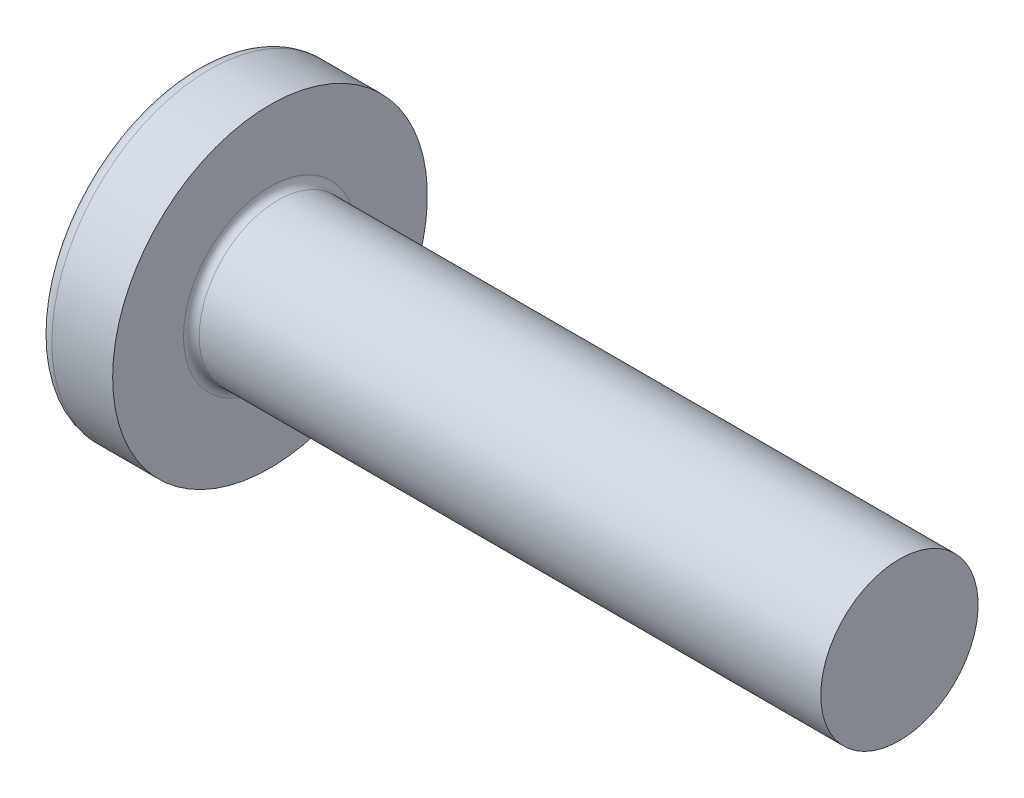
ISO-10303-21;
HEADER;
FILE_DESCRIPTION(('STEP AP214'),'2;1');
FILE_NAME('part.step','',(''),(''),'','','');
FILE_SCHEMA(('AUTOMOTIVE_DESIGN { 1 0 10303 214 1 1 1 1 }'));
ENDSEC;
DATA;
#1=APPLICATION_CONTEXT('core data for automotive mechanical design processes');
#2=APPLICATION_PROTOCOL_DEFINITION('international standard','automotive_design',2000,#1);
#3=PRODUCT_CONTEXT('',#1,'mechanical');
#4=PRODUCT('Part','Part','',(#3));
#5=PRODUCT_RELATED_PRODUCT_CATEGORY('part','',(#4));
#6=PRODUCT_DEFINITION_FORMATION('','',#4);
#7=PRODUCT_DEFINITION_CONTEXT('part definition',#1,'design');
#8=PRODUCT_DEFINITION('design','',#6,#7);
#9=PRODUCT_DEFINITION_SHAPE('','',#8);
#10=(LENGTH_UNIT() NAMED_UNIT(*) SI_UNIT(.MILLI.,.METRE.));
#11=(NAMED_UNIT(*) PLANE_ANGLE_UNIT() SI_UNIT($,.RADIAN.));
#12=(NAMED_UNIT(*) SI_UNIT($,.STERADIAN.) SOLID_ANGLE_UNIT());
#13=UNCERTAINTY_MEASURE_WITH_UNIT(LENGTH_MEASURE(1.E-05),#10,'distance_accuracy_value','');
#14=(GEOMETRIC_REPRESENTATION_CONTEXT(3) GLOBAL_UNCERTAINTY_ASSIGNED_CONTEXT((#13)) GLOBAL_UNIT_ASSIGNED_CONTEXT((#10,
#11,#12)) REPRESENTATION_CONTEXT('',''));
#15=CARTESIAN_POINT('',(0.,0.,0.));
#16=DIRECTION('',(0.,0.,1.));
#17=DIRECTION('',(1.,0.,0.));
#18=AXIS2_PLACEMENT_3D('',#15,#16,#17);
#19=CARTESIAN_POINT('',(6.5,0.,0.));
#20=DIRECTION('',(-1.,0.,0.));
#21=DIRECTION('',(0.,1.,0.));
#22=AXIS2_PLACEMENT_3D('',#19,#20,#21);
#23=SPHERICAL_SURFACE('',#22,6.5);
#24=CARTESIAN_POINT('',(1.26538895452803,0.,0.));
#25=DIRECTION('',(-1.,0.,0.));
#26=DIRECTION('',(0.,0.,1.));
#27=AXIS2_PLACEMENT_3D('',#24,#25,#26);
#28=CIRCLE('',#27,3.85342019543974);
#29=CARTESIAN_POINT('',(1.26538895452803,0.,3.85342019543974));
#30=VERTEX_POINT('',#29);
#31=EDGE_CURVE('E209',#30,#30,#28,.T.);
#32=ORIENTED_EDGE('',*,*,#31,.T.);
#33=EDGE_LOOP('',(#32));
#34=FACE_BOUND('',#33,.T.);
#35=CARTESIAN_POINT('',(0.0788099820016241,0.,0.));
#36=DIRECTION('',(1.,0.,0.));
#37=DIRECTION('',(0.,0.,-1.));
#38=AXIS2_PLACEMENT_3D('',#35,#36,#37);
#39=CIRCLE('',#38,1.0091178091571);
#40=CARTESIAN_POINT('',(0.0788099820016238,-0.514999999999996,-0.867809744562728));
#41=VERTEX_POINT('',#40);
#42=CARTESIAN_POINT('',(0.0788099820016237,-0.867809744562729,-0.515));
#43=VERTEX_POINT('',#42);
#44=EDGE_CURVE('E397',#41,#43,#39,.F.);
#45=ORIENTED_EDGE('',*,*,#44,.F.);
#46=CARTESIAN_POINT('',(6.5,-0.515,0.));
#47=DIRECTION('',(0.,1.,0.));
#48=DIRECTION('',(0.,0.,1.));
#49=AXIS2_PLACEMENT_3D('',#46,#47,#48);
#50=CIRCLE('',#49,6.47956595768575);
#51=CARTESIAN_POINT('',(0.331830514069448,-0.514999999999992,-1.98455541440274));
#52=VERTEX_POINT('',#51);
#53=EDGE_CURVE('E254',#52,#41,#50,.T.);
#54=ORIENTED_EDGE('',*,*,#53,.F.);
#55=CARTESIAN_POINT('',(6.06443205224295,0.,0.873614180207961));
#56=DIRECTION('',(0.446197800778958,0.,-0.89493436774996));
#57=DIRECTION('',(-0.89493436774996,0.,-0.446197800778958));
#58=AXIS2_PLACEMENT_3D('',#55,#56,#57);
#59=CIRCLE('',#58,6.4262803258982);
#60=CARTESIAN_POINT('',(0.331830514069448,0.515000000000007,-1.98455541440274));
#61=VERTEX_POINT('',#60);
#62=EDGE_CURVE('E228',#52,#61,#59,.T.);
#63=ORIENTED_EDGE('',*,*,#62,.T.);
#64=CARTESIAN_POINT('',(6.5,0.515,0.));
#65=DIRECTION('',(0.,-1.,0.));
#66=DIRECTION('',(0.,0.,-1.));
#67=AXIS2_PLACEMENT_3D('',#64,#65,#66);
#68=CIRCLE('',#67,6.47956595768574);
#69=CARTESIAN_POINT('',(0.0788099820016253,0.515000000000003,-0.867809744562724));
#70=VERTEX_POINT('',#69);
#71=EDGE_CURVE('E262',#70,#61,#68,.T.);
#72=ORIENTED_EDGE('',*,*,#71,.F.);
#73=CARTESIAN_POINT('',(0.0788099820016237,0.867809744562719,-0.515));
#74=VERTEX_POINT('',#73);
#75=EDGE_CURVE('E329',#74,#70,#39,.F.);
#76=ORIENTED_EDGE('',*,*,#75,.F.);
#77=CARTESIAN_POINT('',(6.5,0.,-0.515));
#78=DIRECTION('',(0.,0.,1.));
#79=DIRECTION('',(1.,0.,0.));
#80=AXIS2_PLACEMENT_3D('',#77,#78,#79);
#81=CIRCLE('',#80,6.47956595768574);
#82=CARTESIAN_POINT('',(0.331830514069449,1.98455541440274,-0.515));
#83=VERTEX_POINT('',#82);
#84=EDGE_CURVE('E222',#83,#74,#81,.T.);
#85=ORIENTED_EDGE('',*,*,#84,.F.);
#86=CARTESIAN_POINT('',(6.06443205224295,-0.873614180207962,0.));
#87=DIRECTION('',(0.446197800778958,0.89493436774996,0.));
#88=DIRECTION('',(-0.89493436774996,0.446197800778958,0.));
#89=AXIS2_PLACEMENT_3D('',#86,#87,#88);
#90=CIRCLE('',#89,6.4262803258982);
#91=CARTESIAN_POINT('',(0.331830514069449,1.98455541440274,0.514999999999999));
#92=VERTEX_POINT('',#91);
#93=EDGE_CURVE('E225',#83,#92,#90,.T.);
#94=ORIENTED_EDGE('',*,*,#93,.T.);
#95=CARTESIAN_POINT('',(6.5,0.,0.515));
#96=DIRECTION('',(0.,0.,-1.));
#97=DIRECTION('',(0.,1.,0.));
#98=AXIS2_PLACEMENT_3D('',#95,#96,#97);
#99=CIRCLE('',#98,6.47956595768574);
#100=CARTESIAN_POINT('',(0.0788099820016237,0.867809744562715,0.514999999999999));
#101=VERTEX_POINT('',#100);
#102=EDGE_CURVE('E218',#101,#92,#99,.T.);
#103=ORIENTED_EDGE('',*,*,#102,.F.);
#104=CARTESIAN_POINT('',(0.0788099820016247,0.514999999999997,0.867809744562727));
#105=VERTEX_POINT('',#104);
#106=EDGE_CURVE('E359',#105,#101,#39,.F.);
#107=ORIENTED_EDGE('',*,*,#106,.F.);
#108=CARTESIAN_POINT('',(0.331830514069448,0.514999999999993,1.98455541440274));
#109=VERTEX_POINT('',#108);
#110=EDGE_CURVE('E238',#109,#105,#68,.T.);
#111=ORIENTED_EDGE('',*,*,#110,.F.);
#112=CARTESIAN_POINT('',(6.06443205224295,0.,-0.873614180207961));
#113=DIRECTION('',(0.446197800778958,0.,0.89493436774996));
#114=DIRECTION('',(0.89493436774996,0.,-0.446197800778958));
#115=AXIS2_PLACEMENT_3D('',#112,#113,#114);
#116=CIRCLE('',#115,6.4262803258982);
#117=CARTESIAN_POINT('',(0.331830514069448,-0.515000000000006,1.98455541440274));
#118=VERTEX_POINT('',#117);
#119=EDGE_CURVE('E43',#109,#118,#116,.T.);
#120=ORIENTED_EDGE('',*,*,#119,.T.);
#121=CARTESIAN_POINT('',(0.0788099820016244,-0.515000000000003,0.867809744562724));
#122=VERTEX_POINT('',#121);
#123=EDGE_CURVE('E235',#122,#118,#50,.T.);
#124=ORIENTED_EDGE('',*,*,#123,.F.);
#125=CARTESIAN_POINT('',(0.0788099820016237,-0.867809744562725,0.514999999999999));
#126=VERTEX_POINT('',#125);
#127=EDGE_CURVE('E393',#126,#122,#39,.F.);
#128=ORIENTED_EDGE('',*,*,#127,.F.);
#129=CARTESIAN_POINT('',(0.331830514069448,-1.98455541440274,0.514999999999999));
#130=VERTEX_POINT('',#129);
#131=EDGE_CURVE('E219',#130,#126,#99,.T.);
#132=ORIENTED_EDGE('',*,*,#131,.F.);
#133=CARTESIAN_POINT('',(6.06443205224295,0.87361418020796,0.));
#134=DIRECTION('',(0.446197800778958,-0.89493436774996,0.));
#135=DIRECTION('',(0.89493436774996,0.446197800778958,0.));
#136=AXIS2_PLACEMENT_3D('',#133,#134,#135);
#137=CIRCLE('',#136,6.4262803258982);
#138=CARTESIAN_POINT('',(0.331830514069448,-1.98455541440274,-0.515));
#139=VERTEX_POINT('',#138);
#140=EDGE_CURVE('E215',#130,#139,#137,.T.);
#141=ORIENTED_EDGE('',*,*,#140,.T.);
#142=EDGE_CURVE('E58',#43,#139,#81,.T.);
#143=ORIENTED_EDGE('',*,*,#142,.F.);
#144=EDGE_LOOP('',(#45,#54,#63,#72,#76,#85,#94,#103,#107,#111,#120,#124,#128,#132,#141,#143));
#145=FACE_BOUND('',#144,.T.);
#146=ADVANCED_FACE('F30',(#34,#145),#23,.T.);
#147=CARTESIAN_POINT('',(0.,2.15,-0.515));
#148=DIRECTION('',(0.,0.,1.));
#149=DIRECTION('',(1.,0.,0.));
#150=AXIS2_PLACEMENT_3D('',#147,#148,#149);
#151=PLANE('',#150);
#152=ORIENTED_EDGE('',*,*,#84,.T.);
#153=CARTESIAN_POINT('',(-1.51195208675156,0.994972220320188,-0.515));
#154=CARTESIAN_POINT('',(-1.20405981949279,0.970722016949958,-0.515));
#155=CARTESIAN_POINT('',(-0.896180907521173,0.946299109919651,-0.515));
#156=CARTESIAN_POINT('',(-0.280449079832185,0.896981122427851,-0.515));
#157=CARTESIAN_POINT('',(0.0274038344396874,0.872086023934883,-0.515));
#158=CARTESIAN_POINT('',(0.489146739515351,0.83429553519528,-0.515));
#159=CARTESIAN_POINT('',(0.643055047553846,0.821624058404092,-0.515));
#160=CARTESIAN_POINT('',(0.950856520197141,0.796108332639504,-0.515));
#161=CARTESIAN_POINT('',(1.10474968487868,0.783264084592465,-0.515));
#162=CARTESIAN_POINT('',(1.41251352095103,0.757376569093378,-0.515));
#163=CARTESIAN_POINT('',(1.56638419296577,0.744333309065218,-0.515));
#164=CARTESIAN_POINT('',(1.87410847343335,0.718013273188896,-0.515));
#165=CARTESIAN_POINT('',(2.02796208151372,0.704736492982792,-0.515));
#166=CARTESIAN_POINT('',(2.36455311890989,0.675386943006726,-0.515));
#167=CARTESIAN_POINT('',(2.54728562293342,0.659257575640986,-0.515));
#168=CARTESIAN_POINT('',(2.91270624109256,0.626517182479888,-0.515));
#169=CARTESIAN_POINT('',(3.09539435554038,0.609906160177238,-0.515));
#170=CARTESIAN_POINT('',(3.46069832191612,0.576073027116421,-0.515));
#171=CARTESIAN_POINT('',(3.64331417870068,0.558850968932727,-0.515));
#172=CARTESIAN_POINT('',(4.00847437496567,0.523604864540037,-0.515));
#173=CARTESIAN_POINT('',(4.19101871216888,0.505580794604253,-0.515));
#174=CARTESIAN_POINT('',(4.55606208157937,0.468429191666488,-0.515));
#175=CARTESIAN_POINT('',(4.73856107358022,0.449301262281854,-0.515));
#176=CARTESIAN_POINT('',(5.10337547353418,0.409473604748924,-0.515));
#177=CARTESIAN_POINT('',(5.28569089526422,0.38877400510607,-0.515));
#178=CARTESIAN_POINT('',(5.55897278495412,0.355828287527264,-0.515));
#179=CARTESIAN_POINT('',(5.65005277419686,0.344527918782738,-0.515));
#180=CARTESIAN_POINT('',(5.83209904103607,0.321075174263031,-0.515));
#181=CARTESIAN_POINT('',(5.92306532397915,0.308922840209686,-0.515));
#182=CARTESIAN_POINT('',(6.10486078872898,0.28342733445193,-0.515));
#183=CARTESIAN_POINT('',(6.1956899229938,0.270083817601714,-0.515));
#184=CARTESIAN_POINT('',(6.33172773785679,0.248701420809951,-0.515));
#185=CARTESIAN_POINT('',(6.37704304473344,0.241345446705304,-0.515));
#186=CARTESIAN_POINT('',(6.4675722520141,0.226018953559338,-0.515));
#187=CARTESIAN_POINT('',(6.51278614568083,0.218048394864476,-0.515));
#188=CARTESIAN_POINT('',(6.55793125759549,0.209691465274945,-0.515));
#189=B_SPLINE_CURVE_WITH_KNOTS('',3,(#153,#154,#155,#156,#157,#158,#159,#160,#161,#162,#163,
#164,#165,#166,#167,#168,#169,#170,#171,#172,#173,#174,#175,#176,#177,#178,#179,#180,#181,#182,
#183,#184,#185,#186,#187,#188),.UNSPECIFIED.,.F.,.F.,(4,2,2,2,2,2,2,2,2,2,2,2,2,2,2,2,2,4),(0.,
0.926537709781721,1.85311087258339,2.31639796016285,2.77968256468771,3.24294992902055,
3.70622594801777,4.25655436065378,4.80687878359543,5.35715597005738,5.90744944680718,
6.45794177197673,7.008389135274,7.28372117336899,7.55903973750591,7.83443833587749,
7.97216007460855,8.10989070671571),.UNSPECIFIED.);
#190=CARTESIAN_POINT('',(2.34,0.677477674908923,-0.515));
#191=VERTEX_POINT('',#190);
#192=EDGE_CURVE('E322',#74,#191,#189,.T.);
#193=ORIENTED_EDGE('',*,*,#192,.T.);
#194=DIRECTION('',(0.,1.,0.));
#195=VECTOR('',#194,1.);
#196=CARTESIAN_POINT('',(2.34,-0.983319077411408,-0.515));
#197=LINE('',#196,#195);
#198=CARTESIAN_POINT('',(2.34,0.983319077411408,-0.515));
#199=VERTEX_POINT('',#198);
#200=EDGE_CURVE('E277',#191,#199,#197,.T.);
#201=ORIENTED_EDGE('',*,*,#200,.T.);
#202=DIRECTION('',(0.89493436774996,-0.446197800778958,0.));
#203=VECTOR('',#202,1.);
#204=CARTESIAN_POINT('',(0.,2.15,-0.515));
#205=LINE('',#204,#203);
#206=EDGE_CURVE('E283',#83,#199,#205,.T.);
#207=ORIENTED_EDGE('',*,*,#206,.F.);
#208=EDGE_LOOP('',(#152,#193,#201,#207));
#209=FACE_BOUND('',#208,.T.);
#210=ADVANCED_FACE('F164',(#209),#151,.T.);
#211=CARTESIAN_POINT('',(2.34,-0.983319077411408,-0.515));
#212=VERTEX_POINT('',#211);
#213=CARTESIAN_POINT('',(2.34,-0.677477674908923,-0.515));
#214=VERTEX_POINT('',#213);
#215=EDGE_CURVE('E274',#212,#214,#197,.T.);
#216=ORIENTED_EDGE('',*,*,#215,.T.);
#217=CARTESIAN_POINT('',(-1.51195208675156,-0.994972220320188,-0.515));
#218=CARTESIAN_POINT('',(-1.20405981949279,-0.970722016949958,-0.515));
#219=CARTESIAN_POINT('',(-0.896180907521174,-0.946299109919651,-0.515));
#220=CARTESIAN_POINT('',(-0.280449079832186,-0.896981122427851,-0.515));
#221=CARTESIAN_POINT('',(0.0274038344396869,-0.872086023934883,-0.515));
#222=CARTESIAN_POINT('',(0.48914673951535,-0.83429553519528,-0.515));
#223=CARTESIAN_POINT('',(0.643055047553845,-0.821624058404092,-0.515));
#224=CARTESIAN_POINT('',(0.95085652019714,-0.796108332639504,-0.515));
#225=CARTESIAN_POINT('',(1.10474968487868,-0.783264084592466,-0.515));
#226=CARTESIAN_POINT('',(1.41251352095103,-0.757376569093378,-0.515));
#227=CARTESIAN_POINT('',(1.56638419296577,-0.744333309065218,-0.515));
#228=CARTESIAN_POINT('',(1.87410847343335,-0.718013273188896,-0.515));
#229=CARTESIAN_POINT('',(2.02796208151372,-0.704736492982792,-0.515));
#230=CARTESIAN_POINT('',(2.36455311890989,-0.675386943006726,-0.515));
#231=CARTESIAN_POINT('',(2.54728562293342,-0.659257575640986,-0.515));
#232=CARTESIAN_POINT('',(2.91270624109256,-0.626517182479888,-0.515));
#233=CARTESIAN_POINT('',(3.09539435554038,-0.609906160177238,-0.515));
#234=CARTESIAN_POINT('',(3.46069832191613,-0.576073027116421,-0.515));
#235=CARTESIAN_POINT('',(3.64331417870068,-0.558850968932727,-0.515));
#236=CARTESIAN_POINT('',(4.00847437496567,-0.523604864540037,-0.515));
#237=CARTESIAN_POINT('',(4.19101871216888,-0.505580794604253,-0.515));
#238=CARTESIAN_POINT('',(4.55606208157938,-0.468429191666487,-0.515));
#239=CARTESIAN_POINT('',(4.73856107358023,-0.449301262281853,-0.515));
#240=CARTESIAN_POINT('',(5.10337547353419,-0.409473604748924,-0.515));
#241=CARTESIAN_POINT('',(5.28569089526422,-0.388774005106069,-0.515));
#242=CARTESIAN_POINT('',(5.55897278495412,-0.355828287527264,-0.515));
#243=CARTESIAN_POINT('',(5.65005277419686,-0.344527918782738,-0.515));
#244=CARTESIAN_POINT('',(5.83209904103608,-0.321075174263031,-0.515));
#245=CARTESIAN_POINT('',(5.92306532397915,-0.308922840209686,-0.515));
#246=CARTESIAN_POINT('',(6.10486078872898,-0.28342733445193,-0.515));
#247=CARTESIAN_POINT('',(6.1956899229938,-0.270083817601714,-0.515));
#248=CARTESIAN_POINT('',(6.33172773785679,-0.248701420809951,-0.515));
#249=CARTESIAN_POINT('',(6.37704304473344,-0.241345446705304,-0.515));
#250=CARTESIAN_POINT('',(6.4675722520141,-0.226018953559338,-0.515));
#251=CARTESIAN_POINT('',(6.51278614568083,-0.218048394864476,-0.515));
#252=CARTESIAN_POINT('',(6.55793125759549,-0.209691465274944,-0.515));
#253=B_SPLINE_CURVE_WITH_KNOTS('',3,(#217,#218,#219,#220,#221,#222,#223,#224,#225,#226,#227,
#228,#229,#230,#231,#232,#233,#234,#235,#236,#237,#238,#239,#240,#241,#242,#243,#244,#245,#246,
#247,#248,#249,#250,#251,#252),.UNSPECIFIED.,.F.,.F.,(4,2,2,2,2,2,2,2,2,2,2,2,2,2,2,2,2,4),(0.,
0.926537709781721,1.85311087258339,2.31639796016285,2.77968256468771,3.24294992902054,
3.70622594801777,4.25655436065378,4.80687878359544,5.35715597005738,5.90744944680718,
6.45794177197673,7.008389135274,7.28372117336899,7.55903973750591,7.83443833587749,
7.97216007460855,8.10989070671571),.UNSPECIFIED.);
#254=EDGE_CURVE('E315',#214,#43,#253,.F.);
#255=ORIENTED_EDGE('',*,*,#254,.T.);
#256=ORIENTED_EDGE('',*,*,#142,.T.);
#257=DIRECTION('',(0.89493436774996,0.446197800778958,0.));
#258=VECTOR('',#257,1.);
#259=CARTESIAN_POINT('',(0.,-2.15,-0.515));
#260=LINE('',#259,#258);
#261=EDGE_CURVE('E280',#139,#212,#260,.T.);
#262=ORIENTED_EDGE('',*,*,#261,.T.);
#263=EDGE_LOOP('',(#216,#255,#256,#262));
#264=FACE_BOUND('',#263,.T.);
#265=ADVANCED_FACE('F171',(#264),#151,.T.);
#266=CARTESIAN_POINT('',(0.,-2.15,0.514999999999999));
#267=DIRECTION('',(0.,0.,-1.));
#268=DIRECTION('',(0.,1.,0.));
#269=AXIS2_PLACEMENT_3D('',#266,#267,#268);
#270=PLANE('',#269);
#271=DIRECTION('',(0.,-1.,0.));
#272=VECTOR('',#271,1.);
#273=CARTESIAN_POINT('',(2.34,0.983319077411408,0.515));
#274=LINE('',#273,#272);
#275=CARTESIAN_POINT('',(2.34,0.983319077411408,0.515));
#276=VERTEX_POINT('',#275);
#277=CARTESIAN_POINT('',(2.34,0.677477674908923,0.515));
#278=VERTEX_POINT('',#277);
#279=EDGE_CURVE('E267',#276,#278,#274,.T.);
#280=ORIENTED_EDGE('',*,*,#279,.T.);
#281=CARTESIAN_POINT('',(-1.51195208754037,0.994972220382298,0.514999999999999));
#282=CARTESIAN_POINT('',(-1.20405982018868,0.970722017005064,0.514999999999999));
#283=CARTESIAN_POINT('',(-0.896180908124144,0.946299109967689,0.514999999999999));
#284=CARTESIAN_POINT('',(-0.280449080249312,0.896981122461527,0.515));
#285=CARTESIAN_POINT('',(0.0274038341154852,0.872086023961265,0.515));
#286=CARTESIAN_POINT('',(0.489146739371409,0.834295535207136,0.515));
#287=CARTESIAN_POINT('',(0.643055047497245,0.821624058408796,0.515));
#288=CARTESIAN_POINT('',(0.950856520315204,0.796108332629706,0.515));
#289=CARTESIAN_POINT('',(1.10474968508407,0.783264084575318,0.515));
#290=CARTESIAN_POINT('',(1.41251352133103,0.757376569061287,0.515));
#291=CARTESIAN_POINT('',(1.56638419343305,0.744333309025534,0.515));
#292=CARTESIAN_POINT('',(1.87410847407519,0.718013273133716,0.515));
#293=CARTESIAN_POINT('',(2.02796208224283,0.70473649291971,0.515));
#294=CARTESIAN_POINT('',(2.36455311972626,0.675386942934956,0.515));
#295=CARTESIAN_POINT('',(2.5472856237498,0.659257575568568,0.515));
#296=CARTESIAN_POINT('',(2.91270624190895,0.626517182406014,0.515));
#297=CARTESIAN_POINT('',(3.09539435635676,0.609906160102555,0.515));
#298=CARTESIAN_POINT('',(3.46069832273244,0.576073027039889,0.515));
#299=CARTESIAN_POINT('',(3.64331417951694,0.558850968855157,0.515));
#300=CARTESIAN_POINT('',(4.00847437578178,0.523604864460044,0.515));
#301=CARTESIAN_POINT('',(4.1910187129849,0.505580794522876,0.515));
#302=CARTESIAN_POINT('',(4.55606208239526,0.46842919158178,0.515));
#303=CARTESIAN_POINT('',(4.73856107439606,0.449301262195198,0.515));
#304=CARTESIAN_POINT('',(5.10337547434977,0.409473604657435,0.515));
#305=CARTESIAN_POINT('',(5.28569089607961,0.388774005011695,0.515));
#306=CARTESIAN_POINT('',(5.55897278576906,0.355828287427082,0.515));
#307=CARTESIAN_POINT('',(5.65005277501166,0.344527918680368,0.515));
#308=CARTESIAN_POINT('',(5.83209904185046,0.321075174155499,0.515));
#309=CARTESIAN_POINT('',(5.92306532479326,0.30892284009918,0.515));
#310=CARTESIAN_POINT('',(6.10486078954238,0.283427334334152,0.515));
#311=CARTESIAN_POINT('',(6.19568992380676,0.270083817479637,0.515));
#312=CARTESIAN_POINT('',(6.33172773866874,0.248701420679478,0.515));
#313=CARTESIAN_POINT('',(6.377043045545,0.241345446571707,0.515));
#314=CARTESIAN_POINT('',(6.46757225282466,0.226018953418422,0.515));
#315=CARTESIAN_POINT('',(6.51278614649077,0.218048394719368,0.515));
#316=CARTESIAN_POINT('',(6.55793125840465,0.209691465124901,0.515));
#317=B_SPLINE_CURVE_WITH_KNOTS('',3,(#281,#282,#283,#284,#285,#286,#287,#288,#289,#290,#291,
#292,#293,#294,#295,#296,#297,#298,#299,#300,#301,#302,#303,#304,#305,#306,#307,#308,#309,#310,
#311,#312,#313,#314,#315,#316),.UNSPECIFIED.,.F.,.F.,(4,2,2,2,2,2,2,2,2,2,2,2,2,2,2,2,2,4),(0.,
0.926537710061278,1.85311087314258,2.31639796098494,2.77968256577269,3.24294993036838,
3.70622594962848,4.25655436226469,4.80687878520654,5.3571559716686,5.90744944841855,
6.45794177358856,7.00838913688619,7.28372117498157,7.55903973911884,7.83443833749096,
7.97216007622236,8.10989070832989),.UNSPECIFIED.);
#318=EDGE_CURVE('E360',#278,#101,#317,.F.);
#319=ORIENTED_EDGE('',*,*,#318,.T.);
#320=ORIENTED_EDGE('',*,*,#102,.T.);
#321=DIRECTION('',(0.89493436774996,-0.446197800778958,0.));
#322=VECTOR('',#321,1.);
#323=CARTESIAN_POINT('',(0.,2.15,0.515));
#324=LINE('',#323,#322);
#325=EDGE_CURVE('E282',#92,#276,#324,.T.);
#326=ORIENTED_EDGE('',*,*,#325,.T.);
#327=EDGE_LOOP('',(#280,#319,#320,#326));
#328=FACE_BOUND('',#327,.T.);
#329=ADVANCED_FACE('F310',(#328),#270,.T.);
#330=ORIENTED_EDGE('',*,*,#131,.T.);
#331=CARTESIAN_POINT('',(-1.51195208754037,-0.994972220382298,0.514999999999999));
#332=CARTESIAN_POINT('',(-1.20405982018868,-0.970722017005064,0.514999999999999));
#333=CARTESIAN_POINT('',(-0.896180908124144,-0.946299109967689,0.514999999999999));
#334=CARTESIAN_POINT('',(-0.280449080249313,-0.896981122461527,0.514999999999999));
#335=CARTESIAN_POINT('',(0.0274038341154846,-0.872086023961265,0.514999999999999));
#336=CARTESIAN_POINT('',(0.489146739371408,-0.834295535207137,0.514999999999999));
#337=CARTESIAN_POINT('',(0.643055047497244,-0.821624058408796,0.514999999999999));
#338=CARTESIAN_POINT('',(0.950856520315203,-0.796108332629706,0.514999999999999));
#339=CARTESIAN_POINT('',(1.10474968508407,-0.783264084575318,0.514999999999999));
#340=CARTESIAN_POINT('',(1.41251352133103,-0.757376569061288,0.514999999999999));
#341=CARTESIAN_POINT('',(1.56638419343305,-0.744333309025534,0.515));
#342=CARTESIAN_POINT('',(1.87410847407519,-0.718013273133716,0.515));
#343=CARTESIAN_POINT('',(2.02796208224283,-0.70473649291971,0.515));
#344=CARTESIAN_POINT('',(2.36455311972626,-0.675386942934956,0.515));
#345=CARTESIAN_POINT('',(2.5472856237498,-0.659257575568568,0.515));
#346=CARTESIAN_POINT('',(2.91270624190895,-0.626517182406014,0.515));
#347=CARTESIAN_POINT('',(3.09539435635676,-0.609906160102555,0.515));
#348=CARTESIAN_POINT('',(3.46069832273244,-0.576073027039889,0.515));
#349=CARTESIAN_POINT('',(3.64331417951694,-0.558850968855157,0.515));
#350=CARTESIAN_POINT('',(4.00847437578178,-0.523604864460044,0.515));
#351=CARTESIAN_POINT('',(4.1910187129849,-0.505580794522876,0.515));
#352=CARTESIAN_POINT('',(4.55606208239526,-0.46842919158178,0.515));
#353=CARTESIAN_POINT('',(4.73856107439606,-0.449301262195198,0.515));
#354=CARTESIAN_POINT('',(5.10337547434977,-0.409473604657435,0.515));
#355=CARTESIAN_POINT('',(5.28569089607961,-0.388774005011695,0.515));
#356=CARTESIAN_POINT('',(5.55897278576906,-0.355828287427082,0.515));
#357=CARTESIAN_POINT('',(5.65005277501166,-0.344527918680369,0.515));
#358=CARTESIAN_POINT('',(5.83209904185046,-0.3210751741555,0.515));
#359=CARTESIAN_POINT('',(5.92306532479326,-0.308922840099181,0.515));
#360=CARTESIAN_POINT('',(6.10486078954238,-0.283427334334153,0.515));
#361=CARTESIAN_POINT('',(6.19568992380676,-0.270083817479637,0.515));
#362=CARTESIAN_POINT('',(6.33172773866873,-0.248701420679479,0.515));
#363=CARTESIAN_POINT('',(6.37704304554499,-0.241345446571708,0.515));
#364=CARTESIAN_POINT('',(6.46757225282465,-0.226018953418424,0.515));
#365=CARTESIAN_POINT('',(6.51278614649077,-0.218048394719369,0.515));
#366=CARTESIAN_POINT('',(6.55793125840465,-0.209691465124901,0.515));
#367=B_SPLINE_CURVE_WITH_KNOTS('',3,(#331,#332,#333,#334,#335,#336,#337,#338,#339,#340,#341,
#342,#343,#344,#345,#346,#347,#348,#349,#350,#351,#352,#353,#354,#355,#356,#357,#358,#359,#360,
#361,#362,#363,#364,#365,#366),.UNSPECIFIED.,.F.,.F.,(4,2,2,2,2,2,2,2,2,2,2,2,2,2,2,2,2,4),(0.,
0.926537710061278,1.85311087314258,2.31639796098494,2.77968256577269,3.24294993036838,
3.70622594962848,4.25655436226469,4.80687878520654,5.3571559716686,5.90744944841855,
6.45794177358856,7.00838913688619,7.28372117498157,7.55903973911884,7.83443833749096,
7.97216007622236,8.10989070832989),.UNSPECIFIED.);
#368=CARTESIAN_POINT('',(2.34,-0.677477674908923,0.515));
#369=VERTEX_POINT('',#368);
#370=EDGE_CURVE('E350',#126,#369,#367,.T.);
#371=ORIENTED_EDGE('',*,*,#370,.T.);
#372=CARTESIAN_POINT('',(2.34,-0.983319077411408,0.515));
#373=VERTEX_POINT('',#372);
#374=EDGE_CURVE('E270',#369,#373,#274,.T.);
#375=ORIENTED_EDGE('',*,*,#374,.T.);
#376=DIRECTION('',(0.89493436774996,0.446197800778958,0.));
#377=VECTOR('',#376,1.);
#378=CARTESIAN_POINT('',(0.,-2.15,0.514999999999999));
#379=LINE('',#378,#377);
#380=EDGE_CURVE('E266',#130,#373,#379,.T.);
#381=ORIENTED_EDGE('',*,*,#380,.F.);
#382=EDGE_LOOP('',(#330,#371,#375,#381));
#383=FACE_BOUND('',#382,.T.);
#384=ADVANCED_FACE('F378',(#383),#270,.T.);
#385=CARTESIAN_POINT('',(2.34,0.983319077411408,-0.515));
#386=DIRECTION('',(-1.,0.,0.));
#387=DIRECTION('',(0.,0.,1.));
#388=AXIS2_PLACEMENT_3D('',#385,#386,#387);
#389=PLANE('',#388);
#390=ORIENTED_EDGE('',*,*,#374,.F.);
#391=CARTESIAN_POINT('',(2.34,0.,0.));
#392=DIRECTION('',(-1.,0.,0.));
#393=DIRECTION('',(0.,0.,1.));
#394=AXIS2_PLACEMENT_3D('',#391,#392,#393);
#395=CIRCLE('',#394,0.851);
#396=EDGE_CURVE('E392',#214,#369,#395,.T.);
#397=ORIENTED_EDGE('',*,*,#396,.F.);
#398=ORIENTED_EDGE('',*,*,#215,.F.);
#399=DIRECTION('',(0.,0.,1.));
#400=VECTOR('',#399,1.);
#401=CARTESIAN_POINT('',(2.34,-0.983319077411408,-0.515));
#402=LINE('',#401,#400);
#403=EDGE_CURVE('E263',#212,#373,#402,.T.);
#404=ORIENTED_EDGE('',*,*,#403,.T.);
#405=EDGE_LOOP('',(#390,#397,#398,#404));
#406=FACE_BOUND('',#405,.T.);
#407=ADVANCED_FACE('F375',(#406),#389,.T.);
#408=DIRECTION('',(0.,0.,-1.));
#409=VECTOR('',#408,1.);
#410=CARTESIAN_POINT('',(2.34,-0.515000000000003,0.983319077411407));
#411=LINE('',#410,#409);
#412=CARTESIAN_POINT('',(2.34,-0.514999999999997,-0.677477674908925));
#413=VERTEX_POINT('',#412);
#414=CARTESIAN_POINT('',(2.34,-0.514999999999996,-0.98331907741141));
#415=VERTEX_POINT('',#414);
#416=EDGE_CURVE('E419',#413,#415,#411,.T.);
#417=ORIENTED_EDGE('',*,*,#416,.F.);
#418=CARTESIAN_POINT('',(2.34,0.515000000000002,-0.677477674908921));
#419=VERTEX_POINT('',#418);
#420=EDGE_CURVE('E50',#419,#413,#395,.T.);
#421=ORIENTED_EDGE('',*,*,#420,.F.);
#422=DIRECTION('',(0.,0.,1.));
#423=VECTOR('',#422,1.);
#424=CARTESIAN_POINT('',(2.34,0.515000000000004,-0.983319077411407));
#425=LINE('',#424,#423);
#426=CARTESIAN_POINT('',(2.34,0.515000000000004,-0.983319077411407));
#427=VERTEX_POINT('',#426);
#428=EDGE_CURVE('E418',#427,#419,#425,.T.);
#429=ORIENTED_EDGE('',*,*,#428,.F.);
#430=DIRECTION('',(0.,-1.,0.));
#431=VECTOR('',#430,1.);
#432=CARTESIAN_POINT('',(2.34,0.515000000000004,-0.983319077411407));
#433=LINE('',#432,#431);
#434=EDGE_CURVE('E431',#427,#415,#433,.T.);
#435=ORIENTED_EDGE('',*,*,#434,.T.);
#436=EDGE_LOOP('',(#417,#421,#429,#435));
#437=FACE_BOUND('',#436,.T.);
#438=ADVANCED_FACE('F377',(#437),#389,.T.);
#439=ORIENTED_EDGE('',*,*,#200,.F.);
#440=EDGE_CURVE('E402',#278,#191,#395,.T.);
#441=ORIENTED_EDGE('',*,*,#440,.F.);
#442=ORIENTED_EDGE('',*,*,#279,.F.);
#443=DIRECTION('',(0.,0.,-1.));
#444=VECTOR('',#443,1.);
#445=CARTESIAN_POINT('',(2.34,0.983319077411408,0.515));
#446=LINE('',#445,#444);
#447=EDGE_CURVE('E271',#276,#199,#446,.T.);
#448=ORIENTED_EDGE('',*,*,#447,.T.);
#449=EDGE_LOOP('',(#439,#441,#442,#448));
#450=FACE_BOUND('',#449,.T.);
#451=ADVANCED_FACE('F452',(#450),#389,.T.);
#452=CARTESIAN_POINT('',(2.34,0.514999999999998,0.677477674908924));
#453=VERTEX_POINT('',#452);
#454=CARTESIAN_POINT('',(2.34,0.514999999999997,0.98331907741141));
#455=VERTEX_POINT('',#454);
#456=EDGE_CURVE('E252',#453,#455,#425,.T.);
#457=ORIENTED_EDGE('',*,*,#456,.F.);
#458=CARTESIAN_POINT('',(2.34,-0.515000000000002,0.677477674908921));
#459=VERTEX_POINT('',#458);
#460=EDGE_CURVE('E403',#459,#453,#395,.T.);
#461=ORIENTED_EDGE('',*,*,#460,.F.);
#462=CARTESIAN_POINT('',(2.34,-0.515000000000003,0.983319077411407));
#463=VERTEX_POINT('',#462);
#464=EDGE_CURVE('E434',#463,#459,#411,.T.);
#465=ORIENTED_EDGE('',*,*,#464,.F.);
#466=DIRECTION('',(0.,1.,0.));
#467=VECTOR('',#466,1.);
#468=CARTESIAN_POINT('',(2.34,-0.515000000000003,0.983319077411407));
#469=LINE('',#468,#467);
#470=EDGE_CURVE('E425',#463,#455,#469,.T.);
#471=ORIENTED_EDGE('',*,*,#470,.T.);
#472=EDGE_LOOP('',(#457,#461,#465,#471));
#473=FACE_BOUND('',#472,.T.);
#474=ADVANCED_FACE('F369',(#473),#389,.T.);
#475=CARTESIAN_POINT('',(0.,0.514999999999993,2.15));
#476=DIRECTION('',(0.,-1.,0.));
#477=DIRECTION('',(1.,0.,0.));
#478=AXIS2_PLACEMENT_3D('',#475,#476,#477);
#479=PLANE('',#478);
#480=ORIENTED_EDGE('',*,*,#110,.T.);
#481=CARTESIAN_POINT('',(-1.51195208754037,0.514999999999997,0.994972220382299));
#482=CARTESIAN_POINT('',(-1.20405982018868,0.514999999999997,0.970722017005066));
#483=CARTESIAN_POINT('',(-0.896180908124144,0.514999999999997,0.94629910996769));
#484=CARTESIAN_POINT('',(-0.280449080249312,0.514999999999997,0.896981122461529));
#485=CARTESIAN_POINT('',(0.0274038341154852,0.514999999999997,0.872086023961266));
#486=CARTESIAN_POINT('',(0.489146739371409,0.514999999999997,0.834295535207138));
#487=CARTESIAN_POINT('',(0.643055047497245,0.514999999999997,0.821624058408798));
#488=CARTESIAN_POINT('',(0.950856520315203,0.514999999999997,0.796108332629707));
#489=CARTESIAN_POINT('',(1.10474968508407,0.514999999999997,0.783264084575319));
#490=CARTESIAN_POINT('',(1.41251352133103,0.514999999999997,0.757376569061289));
#491=CARTESIAN_POINT('',(1.56638419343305,0.514999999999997,0.744333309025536));
#492=CARTESIAN_POINT('',(1.87410847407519,0.514999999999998,0.718013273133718));
#493=CARTESIAN_POINT('',(2.02796208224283,0.514999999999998,0.704736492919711));
#494=CARTESIAN_POINT('',(2.36455311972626,0.514999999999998,0.675386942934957));
#495=CARTESIAN_POINT('',(2.5472856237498,0.514999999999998,0.65925757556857));
#496=CARTESIAN_POINT('',(2.91270624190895,0.514999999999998,0.626517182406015));
#497=CARTESIAN_POINT('',(3.09539435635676,0.514999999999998,0.609906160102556));
#498=CARTESIAN_POINT('',(3.46069832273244,0.514999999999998,0.576073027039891));
#499=CARTESIAN_POINT('',(3.64331417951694,0.514999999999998,0.558850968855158));
#500=CARTESIAN_POINT('',(4.00847437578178,0.514999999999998,0.523604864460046));
#501=CARTESIAN_POINT('',(4.1910187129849,0.514999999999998,0.505580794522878));
#502=CARTESIAN_POINT('',(4.55606208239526,0.514999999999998,0.468429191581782));
#503=CARTESIAN_POINT('',(4.73856107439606,0.514999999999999,0.4493012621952));
#504=CARTESIAN_POINT('',(5.10337547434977,0.514999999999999,0.409473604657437));
#505=CARTESIAN_POINT('',(5.28569089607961,0.514999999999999,0.388774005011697));
#506=CARTESIAN_POINT('',(5.55897278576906,0.514999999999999,0.355828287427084));
#507=CARTESIAN_POINT('',(5.65005277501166,0.514999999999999,0.344527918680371));
#508=CARTESIAN_POINT('',(5.83209904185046,0.514999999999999,0.321075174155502));
#509=CARTESIAN_POINT('',(5.92306532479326,0.514999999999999,0.308922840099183));
#510=CARTESIAN_POINT('',(6.10486078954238,0.514999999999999,0.283427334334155));
#511=CARTESIAN_POINT('',(6.19568992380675,0.514999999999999,0.27008381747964));
#512=CARTESIAN_POINT('',(6.33172773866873,0.514999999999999,0.248701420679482));
#513=CARTESIAN_POINT('',(6.37704304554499,0.514999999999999,0.24134544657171));
#514=CARTESIAN_POINT('',(6.46757225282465,0.514999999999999,0.226018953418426));
#515=CARTESIAN_POINT('',(6.51278614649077,0.514999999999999,0.218048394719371));
#516=CARTESIAN_POINT('',(6.55793125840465,0.514999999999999,0.209691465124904));
#517=B_SPLINE_CURVE_WITH_KNOTS('',3,(#481,#482,#483,#484,#485,#486,#487,#488,#489,#490,#491,
#492,#493,#494,#495,#496,#497,#498,#499,#500,#501,#502,#503,#504,#505,#506,#507,#508,#509,#510,
#511,#512,#513,#514,#515,#516),.UNSPECIFIED.,.F.,.F.,(4,2,2,2,2,2,2,2,2,2,2,2,2,2,2,2,2,4),(0.,
0.926537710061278,1.85311087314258,2.31639796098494,2.77968256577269,3.24294993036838,
3.70622594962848,4.25655436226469,4.80687878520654,5.3571559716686,5.90744944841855,
6.45794177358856,7.00838913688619,7.28372117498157,7.55903973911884,7.83443833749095,
7.97216007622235,8.10989070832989),.UNSPECIFIED.);
#518=EDGE_CURVE('E355',#105,#453,#517,.T.);
#519=ORIENTED_EDGE('',*,*,#518,.T.);
#520=ORIENTED_EDGE('',*,*,#456,.T.);
#521=DIRECTION('',(0.89493436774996,0.,-0.446197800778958));
#522=VECTOR('',#521,1.);
#523=CARTESIAN_POINT('',(0.,0.514999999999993,2.15));
#524=LINE('',#523,#522);
#525=EDGE_CURVE('E245',#109,#455,#524,.T.);
#526=ORIENTED_EDGE('',*,*,#525,.F.);
#527=EDGE_LOOP('',(#480,#519,#520,#526));
#528=FACE_BOUND('',#527,.T.);
#529=ADVANCED_FACE('F249',(#528),#479,.T.);
#530=CARTESIAN_POINT('',(0.,-0.514999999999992,-2.15));
#531=DIRECTION('',(0.,1.,0.));
#532=DIRECTION('',(0.,0.,1.));
#533=AXIS2_PLACEMENT_3D('',#530,#531,#532);
#534=PLANE('',#533);
#535=ORIENTED_EDGE('',*,*,#464,.T.);
#536=CARTESIAN_POINT('',(-1.51195208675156,-0.515000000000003,0.994972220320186));
#537=CARTESIAN_POINT('',(-1.20405981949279,-0.515000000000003,0.970722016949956));
#538=CARTESIAN_POINT('',(-0.896180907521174,-0.515000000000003,0.946299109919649));
#539=CARTESIAN_POINT('',(-0.280449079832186,-0.515000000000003,0.89698112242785));
#540=CARTESIAN_POINT('',(0.0274038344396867,-0.515000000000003,0.872086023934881));
#541=CARTESIAN_POINT('',(0.48914673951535,-0.515000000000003,0.834295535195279));
#542=CARTESIAN_POINT('',(0.643055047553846,-0.515000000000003,0.821624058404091));
#543=CARTESIAN_POINT('',(0.95085652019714,-0.515000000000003,0.796108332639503));
#544=CARTESIAN_POINT('',(1.10474968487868,-0.515000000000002,0.783264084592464));
#545=CARTESIAN_POINT('',(1.41251352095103,-0.515000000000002,0.757376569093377));
#546=CARTESIAN_POINT('',(1.56638419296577,-0.515000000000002,0.744333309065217));
#547=CARTESIAN_POINT('',(1.87410847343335,-0.515000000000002,0.718013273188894));
#548=CARTESIAN_POINT('',(2.02796208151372,-0.515000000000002,0.70473649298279));
#549=CARTESIAN_POINT('',(2.36455311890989,-0.515000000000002,0.675386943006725));
#550=CARTESIAN_POINT('',(2.54728562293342,-0.515000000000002,0.659257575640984));
#551=CARTESIAN_POINT('',(2.91270624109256,-0.515000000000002,0.626517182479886));
#552=CARTESIAN_POINT('',(3.09539435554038,-0.515000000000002,0.609906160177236));
#553=CARTESIAN_POINT('',(3.46069832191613,-0.515000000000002,0.57607302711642));
#554=CARTESIAN_POINT('',(3.64331417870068,-0.515000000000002,0.558850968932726));
#555=CARTESIAN_POINT('',(4.00847437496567,-0.515000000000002,0.523604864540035));
#556=CARTESIAN_POINT('',(4.19101871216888,-0.515000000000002,0.505580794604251));
#557=CARTESIAN_POINT('',(4.55606208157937,-0.515000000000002,0.468429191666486));
#558=CARTESIAN_POINT('',(4.73856107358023,-0.515000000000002,0.449301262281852));
#559=CARTESIAN_POINT('',(5.10337547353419,-0.515000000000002,0.409473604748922));
#560=CARTESIAN_POINT('',(5.28569089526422,-0.515000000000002,0.388774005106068));
#561=CARTESIAN_POINT('',(5.55897278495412,-0.515000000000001,0.355828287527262));
#562=CARTESIAN_POINT('',(5.65005277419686,-0.515000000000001,0.344527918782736));
#563=CARTESIAN_POINT('',(5.83209904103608,-0.515000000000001,0.321075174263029));
#564=CARTESIAN_POINT('',(5.92306532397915,-0.515000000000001,0.308922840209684));
#565=CARTESIAN_POINT('',(6.10486078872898,-0.515000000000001,0.283427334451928));
#566=CARTESIAN_POINT('',(6.1956899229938,-0.515000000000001,0.270083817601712));
#567=CARTESIAN_POINT('',(6.33172773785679,-0.515000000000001,0.248701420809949));
#568=CARTESIAN_POINT('',(6.37704304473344,-0.515000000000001,0.241345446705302));
#569=CARTESIAN_POINT('',(6.4675722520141,-0.515000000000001,0.226018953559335));
#570=CARTESIAN_POINT('',(6.51278614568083,-0.515000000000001,0.218048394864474));
#571=CARTESIAN_POINT('',(6.55793125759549,-0.515000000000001,0.209691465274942));
#572=B_SPLINE_CURVE_WITH_KNOTS('',3,(#536,#537,#538,#539,#540,#541,#542,#543,#544,#545,#546,
#547,#548,#549,#550,#551,#552,#553,#554,#555,#556,#557,#558,#559,#560,#561,#562,#563,#564,#565,
#566,#567,#568,#569,#570,#571),.UNSPECIFIED.,.F.,.F.,(4,2,2,2,2,2,2,2,2,2,2,2,2,2,2,2,2,4),(0.,
0.926537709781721,1.85311087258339,2.31639796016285,2.77968256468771,3.24294992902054,
3.70622594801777,4.25655436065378,4.80687878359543,5.35715597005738,5.90744944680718,
6.45794177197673,7.008389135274,7.28372117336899,7.55903973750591,7.83443833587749,
7.97216007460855,8.10989070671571),.UNSPECIFIED.);
#573=EDGE_CURVE('E328',#459,#122,#572,.F.);
#574=ORIENTED_EDGE('',*,*,#573,.T.);
#575=ORIENTED_EDGE('',*,*,#123,.T.);
#576=DIRECTION('',(0.89493436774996,0.,-0.446197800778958));
#577=VECTOR('',#576,1.);
#578=CARTESIAN_POINT('',(0.,-0.515000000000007,2.15));
#579=LINE('',#578,#577);
#580=EDGE_CURVE('E247',#118,#463,#579,.T.);
#581=ORIENTED_EDGE('',*,*,#580,.T.);
#582=EDGE_LOOP('',(#535,#574,#575,#581));
#583=FACE_BOUND('',#582,.T.);
#584=ADVANCED_FACE('F368',(#583),#534,.T.);
#585=ORIENTED_EDGE('',*,*,#428,.T.);
#586=CARTESIAN_POINT('',(-1.51195208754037,0.515000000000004,-0.994972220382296));
#587=CARTESIAN_POINT('',(-1.20405982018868,0.515000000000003,-0.970722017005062));
#588=CARTESIAN_POINT('',(-0.896180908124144,0.515000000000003,-0.946299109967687));
#589=CARTESIAN_POINT('',(-0.280449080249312,0.515000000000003,-0.896981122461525));
#590=CARTESIAN_POINT('',(0.027403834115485,0.515000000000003,-0.872086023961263));
#591=CARTESIAN_POINT('',(0.489146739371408,0.515000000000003,-0.834295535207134));
#592=CARTESIAN_POINT('',(0.643055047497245,0.515000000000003,-0.821624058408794));
#593=CARTESIAN_POINT('',(0.950856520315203,0.515000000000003,-0.796108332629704));
#594=CARTESIAN_POINT('',(1.10474968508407,0.515000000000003,-0.783264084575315));
#595=CARTESIAN_POINT('',(1.41251352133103,0.515000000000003,-0.757376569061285));
#596=CARTESIAN_POINT('',(1.56638419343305,0.515000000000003,-0.744333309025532));
#597=CARTESIAN_POINT('',(1.87410847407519,0.515000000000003,-0.718013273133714));
#598=CARTESIAN_POINT('',(2.02796208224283,0.515000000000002,-0.704736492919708));
#599=CARTESIAN_POINT('',(2.36455311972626,0.515000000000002,-0.675386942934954));
#600=CARTESIAN_POINT('',(2.5472856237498,0.515000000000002,-0.659257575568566));
#601=CARTESIAN_POINT('',(2.91270624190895,0.515000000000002,-0.626517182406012));
#602=CARTESIAN_POINT('',(3.09539435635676,0.515000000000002,-0.609906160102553));
#603=CARTESIAN_POINT('',(3.46069832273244,0.515000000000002,-0.576073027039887));
#604=CARTESIAN_POINT('',(3.64331417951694,0.515000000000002,-0.558850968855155));
#605=CARTESIAN_POINT('',(4.00847437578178,0.515000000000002,-0.523604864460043));
#606=CARTESIAN_POINT('',(4.1910187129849,0.515000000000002,-0.505580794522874));
#607=CARTESIAN_POINT('',(4.55606208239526,0.515000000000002,-0.468429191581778));
#608=CARTESIAN_POINT('',(4.73856107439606,0.515000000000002,-0.449301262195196));
#609=CARTESIAN_POINT('',(5.10337547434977,0.515000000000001,-0.409473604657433));
#610=CARTESIAN_POINT('',(5.2856908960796,0.515000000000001,-0.388774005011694));
#611=CARTESIAN_POINT('',(5.55897278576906,0.515000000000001,-0.355828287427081));
#612=CARTESIAN_POINT('',(5.65005277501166,0.515000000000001,-0.344527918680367));
#613=CARTESIAN_POINT('',(5.83209904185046,0.515000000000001,-0.321075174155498));
#614=CARTESIAN_POINT('',(5.92306532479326,0.515000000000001,-0.308922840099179));
#615=CARTESIAN_POINT('',(6.10486078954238,0.515000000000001,-0.283427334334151));
#616=CARTESIAN_POINT('',(6.19568992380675,0.515000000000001,-0.270083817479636));
#617=CARTESIAN_POINT('',(6.33172773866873,0.515000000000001,-0.248701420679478));
#618=CARTESIAN_POINT('',(6.37704304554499,0.515000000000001,-0.241345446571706));
#619=CARTESIAN_POINT('',(6.46757225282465,0.515000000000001,-0.226018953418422));
#620=CARTESIAN_POINT('',(6.51278614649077,0.515000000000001,-0.218048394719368));
#621=CARTESIAN_POINT('',(6.55793125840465,0.515000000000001,-0.2096914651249));
#622=B_SPLINE_CURVE_WITH_KNOTS('',3,(#586,#587,#588,#589,#590,#591,#592,#593,#594,#595,#596,
#597,#598,#599,#600,#601,#602,#603,#604,#605,#606,#607,#608,#609,#610,#611,#612,#613,#614,#615,
#616,#617,#618,#619,#620,#621),.UNSPECIFIED.,.F.,.F.,(4,2,2,2,2,2,2,2,2,2,2,2,2,2,2,2,2,4),(0.,
0.926537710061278,1.85311087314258,2.31639796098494,2.77968256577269,3.24294993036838,
3.70622594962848,4.25655436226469,4.80687878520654,5.3571559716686,5.90744944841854,
6.45794177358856,7.00838913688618,7.28372117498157,7.55903973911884,7.83443833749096,
7.97216007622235,8.10989070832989),.UNSPECIFIED.);
#623=EDGE_CURVE('E330',#419,#70,#622,.F.);
#624=ORIENTED_EDGE('',*,*,#623,.T.);
#625=ORIENTED_EDGE('',*,*,#71,.T.);
#626=DIRECTION('',(0.89493436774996,0.,0.446197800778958));
#627=VECTOR('',#626,1.);
#628=CARTESIAN_POINT('',(0.,0.515000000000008,-2.15));
#629=LINE('',#628,#627);
#630=EDGE_CURVE('E256',#61,#427,#629,.T.);
#631=ORIENTED_EDGE('',*,*,#630,.T.);
#632=EDGE_LOOP('',(#585,#624,#625,#631));
#633=FACE_BOUND('',#632,.T.);
#634=ADVANCED_FACE('F370',(#633),#479,.T.);
#635=ORIENTED_EDGE('',*,*,#53,.T.);
#636=CARTESIAN_POINT('',(-1.51195208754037,-0.514999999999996,-0.9949722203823));
#637=CARTESIAN_POINT('',(-1.20405982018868,-0.514999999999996,-0.970722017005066));
#638=CARTESIAN_POINT('',(-0.896180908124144,-0.514999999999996,-0.946299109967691));
#639=CARTESIAN_POINT('',(-0.280449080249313,-0.514999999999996,-0.896981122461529));
#640=CARTESIAN_POINT('',(0.0274038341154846,-0.514999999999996,-0.872086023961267));
#641=CARTESIAN_POINT('',(0.489146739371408,-0.514999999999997,-0.834295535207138));
#642=CARTESIAN_POINT('',(0.643055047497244,-0.514999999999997,-0.821624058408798));
#643=CARTESIAN_POINT('',(0.950856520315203,-0.514999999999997,-0.796108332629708));
#644=CARTESIAN_POINT('',(1.10474968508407,-0.514999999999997,-0.783264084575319));
#645=CARTESIAN_POINT('',(1.41251352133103,-0.514999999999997,-0.757376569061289));
#646=CARTESIAN_POINT('',(1.56638419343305,-0.514999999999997,-0.744333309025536));
#647=CARTESIAN_POINT('',(1.87410847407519,-0.514999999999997,-0.718013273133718));
#648=CARTESIAN_POINT('',(2.02796208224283,-0.514999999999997,-0.704736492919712));
#649=CARTESIAN_POINT('',(2.36455311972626,-0.514999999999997,-0.675386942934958));
#650=CARTESIAN_POINT('',(2.5472856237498,-0.514999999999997,-0.65925757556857));
#651=CARTESIAN_POINT('',(2.91270624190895,-0.514999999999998,-0.626517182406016));
#652=CARTESIAN_POINT('',(3.09539435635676,-0.514999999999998,-0.609906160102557));
#653=CARTESIAN_POINT('',(3.46069832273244,-0.514999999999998,-0.576073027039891));
#654=CARTESIAN_POINT('',(3.64331417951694,-0.514999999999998,-0.558850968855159));
#655=CARTESIAN_POINT('',(4.00847437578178,-0.514999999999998,-0.523604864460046));
#656=CARTESIAN_POINT('',(4.1910187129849,-0.514999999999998,-0.505580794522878));
#657=CARTESIAN_POINT('',(4.55606208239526,-0.514999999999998,-0.468429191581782));
#658=CARTESIAN_POINT('',(4.73856107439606,-0.514999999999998,-0.4493012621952));
#659=CARTESIAN_POINT('',(5.10337547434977,-0.514999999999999,-0.409473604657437));
#660=CARTESIAN_POINT('',(5.28569089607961,-0.514999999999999,-0.388774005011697));
#661=CARTESIAN_POINT('',(5.55897278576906,-0.514999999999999,-0.355828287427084));
#662=CARTESIAN_POINT('',(5.65005277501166,-0.514999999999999,-0.344527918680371));
#663=CARTESIAN_POINT('',(5.83209904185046,-0.514999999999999,-0.321075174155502));
#664=CARTESIAN_POINT('',(5.92306532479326,-0.514999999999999,-0.308922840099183));
#665=CARTESIAN_POINT('',(6.10486078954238,-0.514999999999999,-0.283427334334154));
#666=CARTESIAN_POINT('',(6.19568992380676,-0.514999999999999,-0.270083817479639));
#667=CARTESIAN_POINT('',(6.33172773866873,-0.514999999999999,-0.248701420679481));
#668=CARTESIAN_POINT('',(6.37704304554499,-0.514999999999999,-0.241345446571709));
#669=CARTESIAN_POINT('',(6.46757225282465,-0.514999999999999,-0.226018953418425));
#670=CARTESIAN_POINT('',(6.51278614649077,-0.514999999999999,-0.218048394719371));
#671=CARTESIAN_POINT('',(6.55793125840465,-0.514999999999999,-0.209691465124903));
#672=B_SPLINE_CURVE_WITH_KNOTS('',3,(#636,#637,#638,#639,#640,#641,#642,#643,#644,#645,#646,
#647,#648,#649,#650,#651,#652,#653,#654,#655,#656,#657,#658,#659,#660,#661,#662,#663,#664,#665,
#666,#667,#668,#669,#670,#671),.UNSPECIFIED.,.F.,.F.,(4,2,2,2,2,2,2,2,2,2,2,2,2,2,2,2,2,4),(0.,
0.926537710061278,1.85311087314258,2.31639796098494,2.77968256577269,3.24294993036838,
3.70622594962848,4.25655436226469,4.80687878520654,5.3571559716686,5.90744944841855,
6.45794177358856,7.00838913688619,7.28372117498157,7.55903973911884,7.83443833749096,
7.97216007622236,8.10989070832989),.UNSPECIFIED.);
#673=EDGE_CURVE('E11',#41,#413,#672,.T.);
#674=ORIENTED_EDGE('',*,*,#673,.T.);
#675=ORIENTED_EDGE('',*,*,#416,.T.);
#676=DIRECTION('',(0.89493436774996,0.,0.446197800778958));
#677=VECTOR('',#676,1.);
#678=CARTESIAN_POINT('',(0.,-0.514999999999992,-2.15));
#679=LINE('',#678,#677);
#680=EDGE_CURVE('E429',#52,#415,#679,.T.);
#681=ORIENTED_EDGE('',*,*,#680,.F.);
#682=EDGE_LOOP('',(#635,#674,#675,#681));
#683=FACE_BOUND('',#682,.T.);
#684=ADVANCED_FACE('F195',(#683),#534,.T.);
#685=CARTESIAN_POINT('',(-25.4,0.,0.));
#686=DIRECTION('',(-1.,0.,0.));
#687=DIRECTION('',(0.,0.,1.));
#688=AXIS2_PLACEMENT_3D('',#685,#686,#687);
#689=CYLINDRICAL_SURFACE('',#688,2.);
#690=CARTESIAN_POINT('',(3.3,0.,0.));
#691=DIRECTION('',(-1.,0.,0.));
#692=DIRECTION('',(0.,0.,1.));
#693=AXIS2_PLACEMENT_3D('',#690,#691,#692);
#694=CIRCLE('',#693,2.);
#695=CARTESIAN_POINT('',(3.3,0.,2.));
#696=VERTEX_POINT('',#695);
#697=EDGE_CURVE('E206',#696,#696,#694,.F.);
#698=ORIENTED_EDGE('',*,*,#697,.T.);
#699=EDGE_LOOP('',(#698));
#700=FACE_BOUND('',#699,.T.);
#701=CARTESIAN_POINT('',(19.1,0.,0.));
#702=DIRECTION('',(-1.,0.,0.));
#703=DIRECTION('',(0.,0.,1.));
#704=AXIS2_PLACEMENT_3D('',#701,#702,#703);
#705=CIRCLE('',#704,2.);
#706=CARTESIAN_POINT('',(19.1,0.,2.));
#707=VERTEX_POINT('',#706);
#708=EDGE_CURVE('E286',#707,#707,#705,.T.);
#709=ORIENTED_EDGE('',*,*,#708,.T.);
#710=EDGE_LOOP('',(#709));
#711=FACE_BOUND('',#710,.T.);
#712=ADVANCED_FACE('F32',(#700,#711),#689,.T.);
#713=CARTESIAN_POINT('',(3.1,2.,0.));
#714=DIRECTION('',(-1.,0.,0.));
#715=DIRECTION('',(0.,0.,1.));
#716=AXIS2_PLACEMENT_3D('',#713,#714,#715);
#717=PLANE('',#716);
#718=CARTESIAN_POINT('',(3.1,0.,0.));
#719=DIRECTION('',(-1.,0.,0.));
#720=DIRECTION('',(0.,0.,1.));
#721=AXIS2_PLACEMENT_3D('',#718,#719,#720);
#722=CIRCLE('',#721,2.2);
#723=CARTESIAN_POINT('',(3.1,0.,2.2));
#724=VERTEX_POINT('',#723);
#725=EDGE_CURVE('E200',#724,#724,#722,.T.);
#726=ORIENTED_EDGE('',*,*,#725,.T.);
#727=EDGE_LOOP('',(#726));
#728=FACE_BOUND('',#727,.T.);
#729=CARTESIAN_POINT('',(3.1,0.,0.));
#730=DIRECTION('',(-1.,0.,0.));
#731=DIRECTION('',(0.,0.,1.));
#732=AXIS2_PLACEMENT_3D('',#729,#730,#731);
#733=CIRCLE('',#732,4.);
#734=CARTESIAN_POINT('',(3.1,0.,4.));
#735=VERTEX_POINT('',#734);
#736=EDGE_CURVE('E203',#735,#735,#733,.T.);
#737=ORIENTED_EDGE('',*,*,#736,.F.);
#738=EDGE_LOOP('',(#737));
#739=FACE_BOUND('',#738,.T.);
#740=ADVANCED_FACE('F186',(#728,#739),#717,.F.);
#741=CARTESIAN_POINT('',(-25.4,0.,0.));
#742=DIRECTION('',(-1.,0.,0.));
#743=DIRECTION('',(0.,0.,1.));
#744=AXIS2_PLACEMENT_3D('',#741,#742,#743);
#745=CYLINDRICAL_SURFACE('',#744,4.);
#746=ORIENTED_EDGE('',*,*,#736,.T.);
#747=EDGE_LOOP('',(#746));
#748=FACE_BOUND('',#747,.T.);
#749=CARTESIAN_POINT('',(1.55530587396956,0.,0.));
#750=DIRECTION('',(-1.,0.,0.));
#751=DIRECTION('',(0.,0.,1.));
#752=AXIS2_PLACEMENT_3D('',#749,#750,#751);
#753=CIRCLE('',#752,4.);
#754=CARTESIAN_POINT('',(1.55530587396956,0.,4.));
#755=VERTEX_POINT('',#754);
#756=EDGE_CURVE('E204',#755,#755,#753,.T.);
#757=ORIENTED_EDGE('',*,*,#756,.F.);
#758=EDGE_LOOP('',(#757));
#759=FACE_BOUND('',#758,.T.);
#760=ADVANCED_FACE('F183',(#748,#759),#745,.T.);
#761=CARTESIAN_POINT('',(1.55530587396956,0.,0.));
#762=DIRECTION('',(-1.,0.,0.));
#763=DIRECTION('',(0.,0.,1.));
#764=AXIS2_PLACEMENT_3D('',#761,#762,#763);
#765=TOROIDAL_SURFACE('',#764,3.64,0.36);
#766=ORIENTED_EDGE('',*,*,#756,.T.);
#767=EDGE_LOOP('',(#766));
#768=FACE_BOUND('',#767,.T.);
#769=ORIENTED_EDGE('',*,*,#31,.F.);
#770=EDGE_LOOP('',(#769));
#771=FACE_BOUND('',#770,.T.);
#772=ADVANCED_FACE('F180',(#768,#771),#765,.T.);
#773=CARTESIAN_POINT('',(19.1,2.,0.));
#774=DIRECTION('',(1.,0.,0.));
#775=DIRECTION('',(0.,0.,-1.));
#776=AXIS2_PLACEMENT_3D('',#773,#774,#775);
#777=PLANE('',#776);
#778=ORIENTED_EDGE('',*,*,#708,.F.);
#779=EDGE_LOOP('',(#778));
#780=FACE_BOUND('',#779,.T.);
#781=ADVANCED_FACE('F178',(#780),#777,.T.);
#782=CARTESIAN_POINT('',(3.3,0.,0.));
#783=DIRECTION('',(-1.,0.,0.));
#784=DIRECTION('',(0.,0.,1.));
#785=AXIS2_PLACEMENT_3D('',#782,#783,#784);
#786=TOROIDAL_SURFACE('',#785,2.2,0.2);
#787=ORIENTED_EDGE('',*,*,#697,.F.);
#788=EDGE_LOOP('',(#787));
#789=FACE_BOUND('',#788,.T.);
#790=ORIENTED_EDGE('',*,*,#725,.F.);
#791=EDGE_LOOP('',(#790));
#792=FACE_BOUND('',#791,.T.);
#793=ADVANCED_FACE('F295',(#789,#792),#786,.F.);
#794=CARTESIAN_POINT('',(2.34,0.983319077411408,0.515));
#795=DIRECTION('',(0.446197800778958,0.89493436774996,0.));
#796=DIRECTION('',(-0.89493436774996,0.446197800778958,0.));
#797=AXIS2_PLACEMENT_3D('',#794,#795,#796);
#798=PLANE('',#797);
#799=ORIENTED_EDGE('',*,*,#206,.T.);
#800=ORIENTED_EDGE('',*,*,#447,.F.);
#801=ORIENTED_EDGE('',*,*,#325,.F.);
#802=ORIENTED_EDGE('',*,*,#93,.F.);
#803=EDGE_LOOP('',(#799,#800,#801,#802));
#804=FACE_BOUND('',#803,.T.);
#805=ADVANCED_FACE('F298',(#804),#798,.F.);
#806=CARTESIAN_POINT('',(2.34,-0.983319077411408,-0.515));
#807=DIRECTION('',(0.446197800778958,-0.89493436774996,0.));
#808=DIRECTION('',(0.89493436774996,0.446197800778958,0.));
#809=AXIS2_PLACEMENT_3D('',#806,#807,#808);
#810=PLANE('',#809);
#811=ORIENTED_EDGE('',*,*,#380,.T.);
#812=ORIENTED_EDGE('',*,*,#403,.F.);
#813=ORIENTED_EDGE('',*,*,#261,.F.);
#814=ORIENTED_EDGE('',*,*,#140,.F.);
#815=EDGE_LOOP('',(#811,#812,#813,#814));
#816=FACE_BOUND('',#815,.T.);
#817=ADVANCED_FACE('F303',(#816),#810,.F.);
#818=CARTESIAN_POINT('',(2.34,-0.515000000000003,0.983319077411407));
#819=DIRECTION('',(0.446197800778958,0.,0.89493436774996));
#820=DIRECTION('',(-0.89493436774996,0.,0.446197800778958));
#821=AXIS2_PLACEMENT_3D('',#818,#819,#820);
#822=PLANE('',#821);
#823=ORIENTED_EDGE('',*,*,#525,.T.);
#824=ORIENTED_EDGE('',*,*,#470,.F.);
#825=ORIENTED_EDGE('',*,*,#580,.F.);
#826=ORIENTED_EDGE('',*,*,#119,.F.);
#827=EDGE_LOOP('',(#823,#824,#825,#826));
#828=FACE_BOUND('',#827,.T.);
#829=ADVANCED_FACE('F243',(#828),#822,.F.);
#830=CARTESIAN_POINT('',(2.34,0.515000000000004,-0.983319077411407));
#831=DIRECTION('',(0.446197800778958,0.,-0.89493436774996));
#832=DIRECTION('',(0.89493436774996,0.,0.446197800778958));
#833=AXIS2_PLACEMENT_3D('',#830,#831,#832);
#834=PLANE('',#833);
#835=ORIENTED_EDGE('',*,*,#680,.T.);
#836=ORIENTED_EDGE('',*,*,#434,.F.);
#837=ORIENTED_EDGE('',*,*,#630,.F.);
#838=ORIENTED_EDGE('',*,*,#62,.F.);
#839=EDGE_LOOP('',(#835,#836,#837,#838));
#840=FACE_BOUND('',#839,.T.);
#841=ADVANCED_FACE('F341',(#840),#834,.F.);
#842=CARTESIAN_POINT('',(2.34,0.,0.));
#843=DIRECTION('',(-1.,0.,0.));
#844=DIRECTION('',(0.,0.,1.));
#845=AXIS2_PLACEMENT_3D('',#842,#843,#844);
#846=CONICAL_SURFACE('',#845,0.851,0.0698131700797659);
#847=EDGE_CURVE('E401',#453,#278,#395,.T.);
#848=ORIENTED_EDGE('',*,*,#847,.F.);
#849=ORIENTED_EDGE('',*,*,#518,.F.);
#850=ORIENTED_EDGE('',*,*,#106,.T.);
#851=ORIENTED_EDGE('',*,*,#318,.F.);
#852=EDGE_LOOP('',(#848,#849,#850,#851));
#853=FACE_BOUND('',#852,.T.);
#854=ADVANCED_FACE('F161',(#853),#846,.F.);
#855=ORIENTED_EDGE('',*,*,#127,.T.);
#856=ORIENTED_EDGE('',*,*,#573,.F.);
#857=EDGE_CURVE('E408',#369,#459,#395,.T.);
#858=ORIENTED_EDGE('',*,*,#857,.F.);
#859=ORIENTED_EDGE('',*,*,#370,.F.);
#860=EDGE_LOOP('',(#855,#856,#858,#859));
#861=FACE_BOUND('',#860,.T.);
#862=ADVANCED_FACE('F445',(#861),#846,.F.);
#863=ORIENTED_EDGE('',*,*,#75,.T.);
#864=ORIENTED_EDGE('',*,*,#623,.F.);
#865=EDGE_CURVE('E407',#191,#419,#395,.T.);
#866=ORIENTED_EDGE('',*,*,#865,.F.);
#867=ORIENTED_EDGE('',*,*,#192,.F.);
#868=EDGE_LOOP('',(#863,#864,#866,#867));
#869=FACE_BOUND('',#868,.T.);
#870=ADVANCED_FACE('F159',(#869),#846,.F.);
#871=EDGE_CURVE('E411',#413,#214,#395,.T.);
#872=ORIENTED_EDGE('',*,*,#871,.F.);
#873=ORIENTED_EDGE('',*,*,#673,.F.);
#874=ORIENTED_EDGE('',*,*,#44,.T.);
#875=ORIENTED_EDGE('',*,*,#254,.F.);
#876=EDGE_LOOP('',(#872,#873,#874,#875));
#877=FACE_BOUND('',#876,.T.);
#878=ADVANCED_FACE('F154',(#877),#846,.F.);
#879=CARTESIAN_POINT('',(2.6165066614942,0.,0.));
#880=DIRECTION('',(-1.,0.,0.));
#881=DIRECTION('',(0.,0.,1.));
#882=AXIS2_PLACEMENT_3D('',#879,#880,#881);
#883=CONICAL_SURFACE('',#882,0.,1.25663706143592);
#884=ORIENTED_EDGE('',*,*,#847,.T.);
#885=ORIENTED_EDGE('',*,*,#440,.T.);
#886=ORIENTED_EDGE('',*,*,#865,.T.);
#887=ORIENTED_EDGE('',*,*,#420,.T.);
#888=ORIENTED_EDGE('',*,*,#871,.T.);
#889=ORIENTED_EDGE('',*,*,#396,.T.);
#890=ORIENTED_EDGE('',*,*,#857,.T.);
#891=ORIENTED_EDGE('',*,*,#460,.T.);
#892=EDGE_LOOP('',(#884,#885,#886,#887,#888,#889,#890,#891));
#893=FACE_BOUND('',#892,.T.);
#894=CARTESIAN_POINT('',(2.6165066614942,0.,0.));
#895=VERTEX_POINT('',#894);
#896=VERTEX_LOOP('',#895);
#897=FACE_BOUND('',#896,.T.);
#898=ADVANCED_FACE('F152',(#893,#897),#883,.F.);
#899=CLOSED_SHELL('',(#146,#210,#265,#329,#384,#407,#438,#451,#474,#529,#584,#634,#684,#712,
#740,#760,#772,#781,#793,#805,#817,#829,#841,#854,#862,#870,#878,#898));
#900=MANIFOLD_SOLID_BREP('B2',#899);
#901=ADVANCED_BREP_SHAPE_REPRESENTATION('',(#18,#900),#14);
#902=SHAPE_DEFINITION_REPRESENTATION(#9,#901);
ENDSEC;
END-ISO-10303-21;
